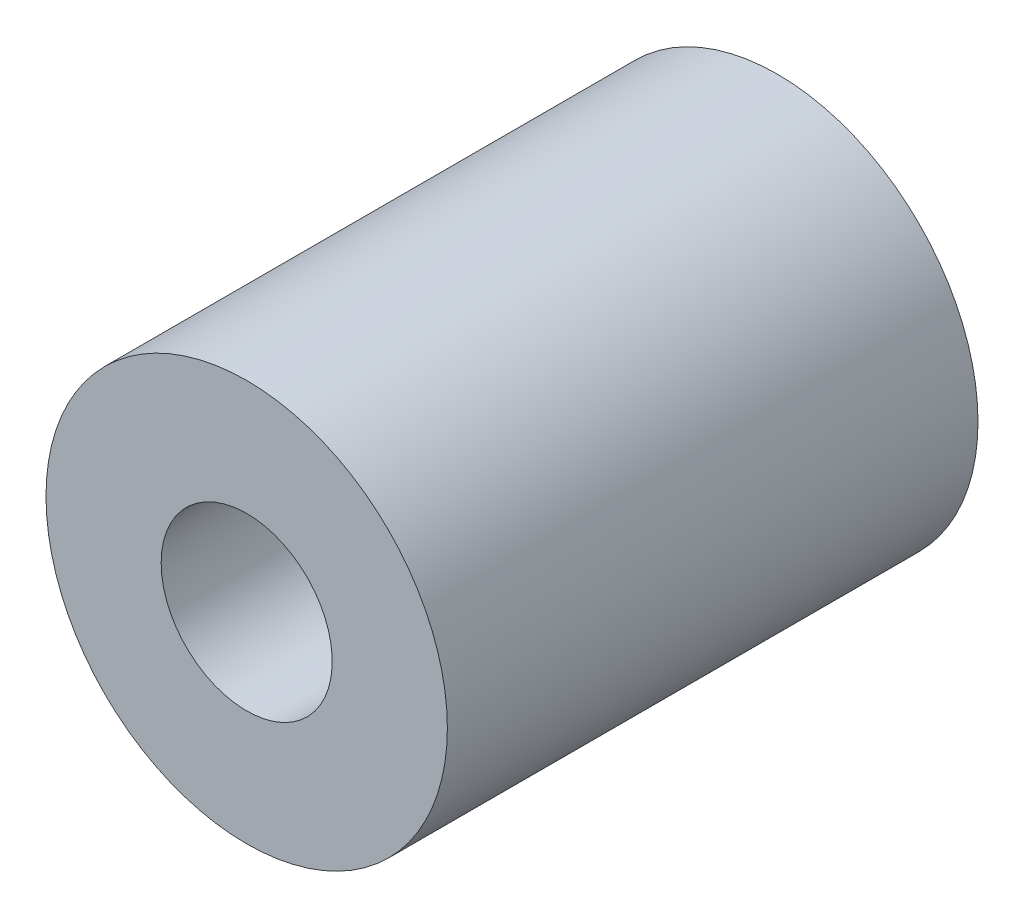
ISO-10303-21;
HEADER;
FILE_DESCRIPTION(('STEP AP214'),'2;1');
FILE_NAME('part.step','',(''),(''),'','','');
FILE_SCHEMA(('AUTOMOTIVE_DESIGN { 1 0 10303 214 1 1 1 1 }'));
ENDSEC;
DATA;
#1=APPLICATION_CONTEXT('core data for automotive mechanical design processes');
#2=APPLICATION_PROTOCOL_DEFINITION('international standard','automotive_design',2000,#1);
#3=PRODUCT_CONTEXT('',#1,'mechanical');
#4=PRODUCT('Part','Part','',(#3));
#5=PRODUCT_RELATED_PRODUCT_CATEGORY('part','',(#4));
#6=PRODUCT_DEFINITION_FORMATION('','',#4);
#7=PRODUCT_DEFINITION_CONTEXT('part definition',#1,'design');
#8=PRODUCT_DEFINITION('design','',#6,#7);
#9=PRODUCT_DEFINITION_SHAPE('','',#8);
#10=(LENGTH_UNIT() NAMED_UNIT(*) SI_UNIT(.MILLI.,.METRE.));
#11=(NAMED_UNIT(*) PLANE_ANGLE_UNIT() SI_UNIT($,.RADIAN.));
#12=(NAMED_UNIT(*) SI_UNIT($,.STERADIAN.) SOLID_ANGLE_UNIT());
#13=UNCERTAINTY_MEASURE_WITH_UNIT(LENGTH_MEASURE(1.E-05),#10,'distance_accuracy_value','');
#14=(GEOMETRIC_REPRESENTATION_CONTEXT(3) GLOBAL_UNCERTAINTY_ASSIGNED_CONTEXT((#13)) GLOBAL_UNIT_ASSIGNED_CONTEXT((#10,
#11,#12)) REPRESENTATION_CONTEXT('',''));
#15=CARTESIAN_POINT('',(0.,0.,0.));
#16=DIRECTION('',(0.,0.,1.));
#17=DIRECTION('',(1.,0.,0.));
#18=AXIS2_PLACEMENT_3D('',#15,#16,#17);
#19=CARTESIAN_POINT('',(0.,0.,24.8158));
#20=DIRECTION('',(0.,0.,1.));
#21=DIRECTION('',(1.,0.,0.));
#22=AXIS2_PLACEMENT_3D('',#19,#20,#21);
#23=PLANE('',#22);
#24=CARTESIAN_POINT('',(0.,0.,24.8158));
#25=DIRECTION('',(0.,0.,1.));
#26=DIRECTION('',(1.,0.,0.));
#27=AXIS2_PLACEMENT_3D('',#24,#25,#26);
#28=CIRCLE('',#27,9.3853);
#29=CARTESIAN_POINT('',(-9.3853,0.,24.8158));
#30=VERTEX_POINT('',#29);
#31=EDGE_CURVE('E10',#30,#30,#28,.T.);
#32=ORIENTED_EDGE('',*,*,#31,.T.);
#33=EDGE_LOOP('',(#32));
#34=FACE_BOUND('',#33,.T.);
#35=CARTESIAN_POINT('',(0.,0.,24.8158));
#36=DIRECTION('',(0.,0.,1.));
#37=DIRECTION('',(1.,0.,0.));
#38=AXIS2_PLACEMENT_3D('',#35,#36,#37);
#39=CIRCLE('',#38,4.);
#40=CARTESIAN_POINT('',(-4.,0.,24.8158));
#41=VERTEX_POINT('',#40);
#42=EDGE_CURVE('E48',#41,#41,#39,.T.);
#43=ORIENTED_EDGE('',*,*,#42,.F.);
#44=EDGE_LOOP('',(#43));
#45=FACE_BOUND('',#44,.T.);
#46=ADVANCED_FACE('F40',(#34,#45),#23,.T.);
#47=CARTESIAN_POINT('',(0.,0.,0.));
#48=DIRECTION('',(0.,0.,1.));
#49=DIRECTION('',(1.,0.,0.));
#50=AXIS2_PLACEMENT_3D('',#47,#48,#49);
#51=PLANE('',#50);
#52=CARTESIAN_POINT('',(0.,0.,0.));
#53=DIRECTION('',(0.,0.,1.));
#54=DIRECTION('',(1.,0.,0.));
#55=AXIS2_PLACEMENT_3D('',#52,#53,#54);
#56=CIRCLE('',#55,9.3853);
#57=CARTESIAN_POINT('',(-9.3853,0.,0.));
#58=VERTEX_POINT('',#57);
#59=EDGE_CURVE('E41',#58,#58,#56,.T.);
#60=ORIENTED_EDGE('',*,*,#59,.F.);
#61=EDGE_LOOP('',(#60));
#62=FACE_BOUND('',#61,.T.);
#63=CARTESIAN_POINT('',(0.,0.,0.));
#64=DIRECTION('',(0.,0.,1.));
#65=DIRECTION('',(1.,0.,0.));
#66=AXIS2_PLACEMENT_3D('',#63,#64,#65);
#67=CIRCLE('',#66,4.);
#68=CARTESIAN_POINT('',(-4.,0.,0.));
#69=VERTEX_POINT('',#68);
#70=EDGE_CURVE('E49',#69,#69,#67,.T.);
#71=ORIENTED_EDGE('',*,*,#70,.T.);
#72=EDGE_LOOP('',(#71));
#73=FACE_BOUND('',#72,.T.);
#74=ADVANCED_FACE('F58',(#62,#73),#51,.F.);
#75=CARTESIAN_POINT('',(0.,0.,24.8158));
#76=DIRECTION('',(0.,0.,-1.));
#77=DIRECTION('',(-1.,0.,0.));
#78=AXIS2_PLACEMENT_3D('',#75,#76,#77);
#79=CYLINDRICAL_SURFACE('',#78,9.3853);
#80=CARTESIAN_POINT('',(-9.3853,0.,24.8158));
#81=CARTESIAN_POINT('',(-9.3853,0.,24.5573020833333));
#82=CARTESIAN_POINT('',(-9.3853,0.,24.2988041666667));
#83=CARTESIAN_POINT('',(-9.3853,0.,23.7818083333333));
#84=CARTESIAN_POINT('',(-9.3853,0.,23.5233104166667));
#85=CARTESIAN_POINT('',(-9.3853,0.,23.0063145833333));
#86=CARTESIAN_POINT('',(-9.3853,0.,22.7478166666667));
#87=CARTESIAN_POINT('',(-9.3853,0.,22.2308208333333));
#88=CARTESIAN_POINT('',(-9.3853,0.,21.9723229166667));
#89=CARTESIAN_POINT('',(-9.3853,0.,21.4553270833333));
#90=CARTESIAN_POINT('',(-9.3853,0.,21.1968291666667));
#91=CARTESIAN_POINT('',(-9.3853,0.,20.6798333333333));
#92=CARTESIAN_POINT('',(-9.3853,0.,20.4213354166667));
#93=CARTESIAN_POINT('',(-9.3853,0.,19.9043395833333));
#94=CARTESIAN_POINT('',(-9.3853,0.,19.6458416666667));
#95=CARTESIAN_POINT('',(-9.3853,0.,19.1288458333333));
#96=CARTESIAN_POINT('',(-9.3853,0.,18.8703479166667));
#97=CARTESIAN_POINT('',(-9.3853,0.,18.3533520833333));
#98=CARTESIAN_POINT('',(-9.3853,0.,18.0948541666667));
#99=CARTESIAN_POINT('',(-9.3853,0.,17.5778583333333));
#100=CARTESIAN_POINT('',(-9.3853,0.,17.3193604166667));
#101=CARTESIAN_POINT('',(-9.3853,0.,16.8023645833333));
#102=CARTESIAN_POINT('',(-9.3853,0.,16.5438666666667));
#103=CARTESIAN_POINT('',(-9.3853,0.,16.0268708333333));
#104=CARTESIAN_POINT('',(-9.3853,0.,15.7683729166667));
#105=CARTESIAN_POINT('',(-9.3853,0.,15.2513770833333));
#106=CARTESIAN_POINT('',(-9.3853,0.,14.9928791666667));
#107=CARTESIAN_POINT('',(-9.3853,0.,14.4758833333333));
#108=CARTESIAN_POINT('',(-9.3853,0.,14.2173854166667));
#109=CARTESIAN_POINT('',(-9.3853,0.,13.7003895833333));
#110=CARTESIAN_POINT('',(-9.3853,0.,13.4418916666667));
#111=CARTESIAN_POINT('',(-9.3853,0.,12.9248958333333));
#112=CARTESIAN_POINT('',(-9.3853,0.,12.6663979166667));
#113=CARTESIAN_POINT('',(-9.3853,0.,12.1494020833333));
#114=CARTESIAN_POINT('',(-9.3853,0.,11.8909041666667));
#115=CARTESIAN_POINT('',(-9.3853,0.,11.3739083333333));
#116=CARTESIAN_POINT('',(-9.3853,0.,11.1154104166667));
#117=CARTESIAN_POINT('',(-9.3853,0.,10.5984145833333));
#118=CARTESIAN_POINT('',(-9.3853,0.,10.3399166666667));
#119=CARTESIAN_POINT('',(-9.3853,0.,9.82292083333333));
#120=CARTESIAN_POINT('',(-9.3853,0.,9.56442291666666));
#121=CARTESIAN_POINT('',(-9.3853,0.,9.04742708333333));
#122=CARTESIAN_POINT('',(-9.3853,0.,8.78892916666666));
#123=CARTESIAN_POINT('',(-9.3853,0.,8.27193333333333));
#124=CARTESIAN_POINT('',(-9.3853,0.,8.01343541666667));
#125=CARTESIAN_POINT('',(-9.3853,0.,7.49643958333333));
#126=CARTESIAN_POINT('',(-9.3853,0.,7.23794166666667));
#127=CARTESIAN_POINT('',(-9.3853,0.,6.72094583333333));
#128=CARTESIAN_POINT('',(-9.3853,0.,6.46244791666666));
#129=CARTESIAN_POINT('',(-9.3853,0.,5.94545208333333));
#130=CARTESIAN_POINT('',(-9.3853,0.,5.68695416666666));
#131=CARTESIAN_POINT('',(-9.3853,0.,5.16995833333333));
#132=CARTESIAN_POINT('',(-9.3853,0.,4.91146041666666));
#133=CARTESIAN_POINT('',(-9.3853,0.,4.39446458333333));
#134=CARTESIAN_POINT('',(-9.3853,0.,4.13596666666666));
#135=CARTESIAN_POINT('',(-9.3853,0.,3.61897083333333));
#136=CARTESIAN_POINT('',(-9.3853,0.,3.36047291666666));
#137=CARTESIAN_POINT('',(-9.3853,0.,2.84347708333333));
#138=CARTESIAN_POINT('',(-9.3853,0.,2.58497916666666));
#139=CARTESIAN_POINT('',(-9.3853,0.,2.06798333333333));
#140=CARTESIAN_POINT('',(-9.3853,0.,1.80948541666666));
#141=CARTESIAN_POINT('',(-9.3853,0.,1.29248958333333));
#142=CARTESIAN_POINT('',(-9.3853,0.,1.03399166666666));
#143=CARTESIAN_POINT('',(-9.3853,0.,0.516995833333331));
#144=CARTESIAN_POINT('',(-9.3853,0.,0.258497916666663));
#145=CARTESIAN_POINT('',(-9.3853,0.,0.));
#146=B_SPLINE_CURVE_WITH_KNOTS('',3,(#80,#81,#82,#83,#84,#85,#86,#87,#88,#89,#90,#91,#92,#93,
#94,#95,#96,#97,#98,#99,#100,#101,#102,#103,#104,#105,#106,#107,#108,#109,#110,#111,#112,#113,
#114,#115,#116,#117,#118,#119,#120,#121,#122,#123,#124,#125,#126,#127,#128,#129,#130,#131,#132,
#133,#134,#135,#136,#137,#138,#139,#140,#141,#142,#143,#144,#145),.UNSPECIFIED.,.F.,.F.,(4,2,2,
2,2,2,2,2,2,2,2,2,2,2,2,2,2,2,2,2,2,2,2,2,2,2,2,2,2,2,2,2,4),(0.,0.775493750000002,1.5509875,
2.32648125,3.101975,3.87746875,4.6529625,5.42845625,6.20395,6.97944375,7.7549375,8.53043125,
9.305925,10.08141875,10.8569125,11.63240625,12.4079,13.18339375,13.9588875,14.73438125,
15.509875,16.28536875,17.0608625,17.83635625,18.61185,19.38734375,20.1628375,20.93833125,
21.713825,22.48931875,23.2648125,24.04030625,24.8158),.UNSPECIFIED.);
#147=EDGE_CURVE('BSEAM39',#30,#58,#146,.T.);
#148=ORIENTED_EDGE('',*,*,#31,.F.);
#149=ORIENTED_EDGE('',*,*,#59,.T.);
#150=ORIENTED_EDGE('',*,*,#147,.T.);
#151=ORIENTED_EDGE('',*,*,#147,.F.);
#152=EDGE_LOOP('',(#148,#150,#149,#151));
#153=FACE_BOUND('',#152,.T.);
#154=ADVANCED_FACE('F39',(#153),#79,.T.);
#155=CARTESIAN_POINT('',(0.,0.,24.8158));
#156=DIRECTION('',(0.,0.,-1.));
#157=DIRECTION('',(-1.,0.,0.));
#158=AXIS2_PLACEMENT_3D('',#155,#156,#157);
#159=CYLINDRICAL_SURFACE('',#158,4.);
#160=CARTESIAN_POINT('',(-4.,0.,24.8158));
#161=CARTESIAN_POINT('',(-4.,0.,24.5573020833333));
#162=CARTESIAN_POINT('',(-4.,0.,24.2988041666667));
#163=CARTESIAN_POINT('',(-4.,0.,23.7818083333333));
#164=CARTESIAN_POINT('',(-4.,0.,23.5233104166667));
#165=CARTESIAN_POINT('',(-4.,0.,23.0063145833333));
#166=CARTESIAN_POINT('',(-4.,0.,22.7478166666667));
#167=CARTESIAN_POINT('',(-4.,0.,22.2308208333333));
#168=CARTESIAN_POINT('',(-4.,0.,21.9723229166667));
#169=CARTESIAN_POINT('',(-4.,0.,21.4553270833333));
#170=CARTESIAN_POINT('',(-4.,0.,21.1968291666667));
#171=CARTESIAN_POINT('',(-4.,0.,20.6798333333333));
#172=CARTESIAN_POINT('',(-4.,0.,20.4213354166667));
#173=CARTESIAN_POINT('',(-4.,0.,19.9043395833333));
#174=CARTESIAN_POINT('',(-4.,0.,19.6458416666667));
#175=CARTESIAN_POINT('',(-4.,0.,19.1288458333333));
#176=CARTESIAN_POINT('',(-4.,0.,18.8703479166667));
#177=CARTESIAN_POINT('',(-4.,0.,18.3533520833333));
#178=CARTESIAN_POINT('',(-4.,0.,18.0948541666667));
#179=CARTESIAN_POINT('',(-4.,0.,17.5778583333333));
#180=CARTESIAN_POINT('',(-4.,0.,17.3193604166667));
#181=CARTESIAN_POINT('',(-4.,0.,16.8023645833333));
#182=CARTESIAN_POINT('',(-4.,0.,16.5438666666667));
#183=CARTESIAN_POINT('',(-4.,0.,16.0268708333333));
#184=CARTESIAN_POINT('',(-4.,0.,15.7683729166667));
#185=CARTESIAN_POINT('',(-4.,0.,15.2513770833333));
#186=CARTESIAN_POINT('',(-4.,0.,14.9928791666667));
#187=CARTESIAN_POINT('',(-4.,0.,14.4758833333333));
#188=CARTESIAN_POINT('',(-4.,0.,14.2173854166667));
#189=CARTESIAN_POINT('',(-4.,0.,13.7003895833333));
#190=CARTESIAN_POINT('',(-4.,0.,13.4418916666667));
#191=CARTESIAN_POINT('',(-4.,0.,12.9248958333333));
#192=CARTESIAN_POINT('',(-4.,0.,12.6663979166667));
#193=CARTESIAN_POINT('',(-4.,0.,12.1494020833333));
#194=CARTESIAN_POINT('',(-4.,0.,11.8909041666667));
#195=CARTESIAN_POINT('',(-4.,0.,11.3739083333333));
#196=CARTESIAN_POINT('',(-4.,0.,11.1154104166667));
#197=CARTESIAN_POINT('',(-4.,0.,10.5984145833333));
#198=CARTESIAN_POINT('',(-4.,0.,10.3399166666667));
#199=CARTESIAN_POINT('',(-4.,0.,9.82292083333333));
#200=CARTESIAN_POINT('',(-4.,0.,9.56442291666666));
#201=CARTESIAN_POINT('',(-4.,0.,9.04742708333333));
#202=CARTESIAN_POINT('',(-4.,0.,8.78892916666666));
#203=CARTESIAN_POINT('',(-4.,0.,8.27193333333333));
#204=CARTESIAN_POINT('',(-4.,0.,8.01343541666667));
#205=CARTESIAN_POINT('',(-4.,0.,7.49643958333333));
#206=CARTESIAN_POINT('',(-4.,0.,7.23794166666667));
#207=CARTESIAN_POINT('',(-4.,0.,6.72094583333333));
#208=CARTESIAN_POINT('',(-4.,0.,6.46244791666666));
#209=CARTESIAN_POINT('',(-4.,0.,5.94545208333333));
#210=CARTESIAN_POINT('',(-4.,0.,5.68695416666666));
#211=CARTESIAN_POINT('',(-4.,0.,5.16995833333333));
#212=CARTESIAN_POINT('',(-4.,0.,4.91146041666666));
#213=CARTESIAN_POINT('',(-4.,0.,4.39446458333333));
#214=CARTESIAN_POINT('',(-4.,0.,4.13596666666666));
#215=CARTESIAN_POINT('',(-4.,0.,3.61897083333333));
#216=CARTESIAN_POINT('',(-4.,0.,3.36047291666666));
#217=CARTESIAN_POINT('',(-4.,0.,2.84347708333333));
#218=CARTESIAN_POINT('',(-4.,0.,2.58497916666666));
#219=CARTESIAN_POINT('',(-4.,0.,2.06798333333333));
#220=CARTESIAN_POINT('',(-4.,0.,1.80948541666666));
#221=CARTESIAN_POINT('',(-4.,0.,1.29248958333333));
#222=CARTESIAN_POINT('',(-4.,0.,1.03399166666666));
#223=CARTESIAN_POINT('',(-4.,0.,0.516995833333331));
#224=CARTESIAN_POINT('',(-4.,0.,0.258497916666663));
#225=CARTESIAN_POINT('',(-4.,0.,0.));
#226=B_SPLINE_CURVE_WITH_KNOTS('',3,(#160,#161,#162,#163,#164,#165,#166,#167,#168,#169,#170,
#171,#172,#173,#174,#175,#176,#177,#178,#179,#180,#181,#182,#183,#184,#185,#186,#187,#188,#189,
#190,#191,#192,#193,#194,#195,#196,#197,#198,#199,#200,#201,#202,#203,#204,#205,#206,#207,#208,
#209,#210,#211,#212,#213,#214,#215,#216,#217,#218,#219,#220,#221,#222,#223,#224,#225),
.UNSPECIFIED.,.F.,.F.,(4,2,2,2,2,2,2,2,2,2,2,2,2,2,2,2,2,2,2,2,2,2,2,2,2,2,2,2,2,2,2,2,4),(0.,
0.775493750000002,1.5509875,2.32648125,3.101975,3.87746875,4.6529625,5.42845625,6.20395,
6.97944375,7.7549375,8.53043125,9.305925,10.08141875,10.8569125,11.63240625,12.4079,13.18339375,
13.9588875,14.73438125,15.509875,16.28536875,17.0608625,17.83635625,18.61185,19.38734375,
20.1628375,20.93833125,21.713825,22.48931875,23.2648125,24.04030625,24.8158),.UNSPECIFIED.);
#227=EDGE_CURVE('BSEAM57',#41,#69,#226,.T.);
#228=ORIENTED_EDGE('',*,*,#42,.T.);
#229=ORIENTED_EDGE('',*,*,#70,.F.);
#230=ORIENTED_EDGE('',*,*,#227,.T.);
#231=ORIENTED_EDGE('',*,*,#227,.F.);
#232=EDGE_LOOP('',(#228,#230,#229,#231));
#233=FACE_BOUND('',#232,.T.);
#234=ADVANCED_FACE('F57',(#233),#159,.F.);
#235=CLOSED_SHELL('',(#46,#74,#154,#234));
#236=MANIFOLD_SOLID_BREP('B2',#235);
#237=ADVANCED_BREP_SHAPE_REPRESENTATION('',(#18,#236),#14);
#238=SHAPE_DEFINITION_REPRESENTATION(#9,#237);
ENDSEC;
END-ISO-10303-21;
